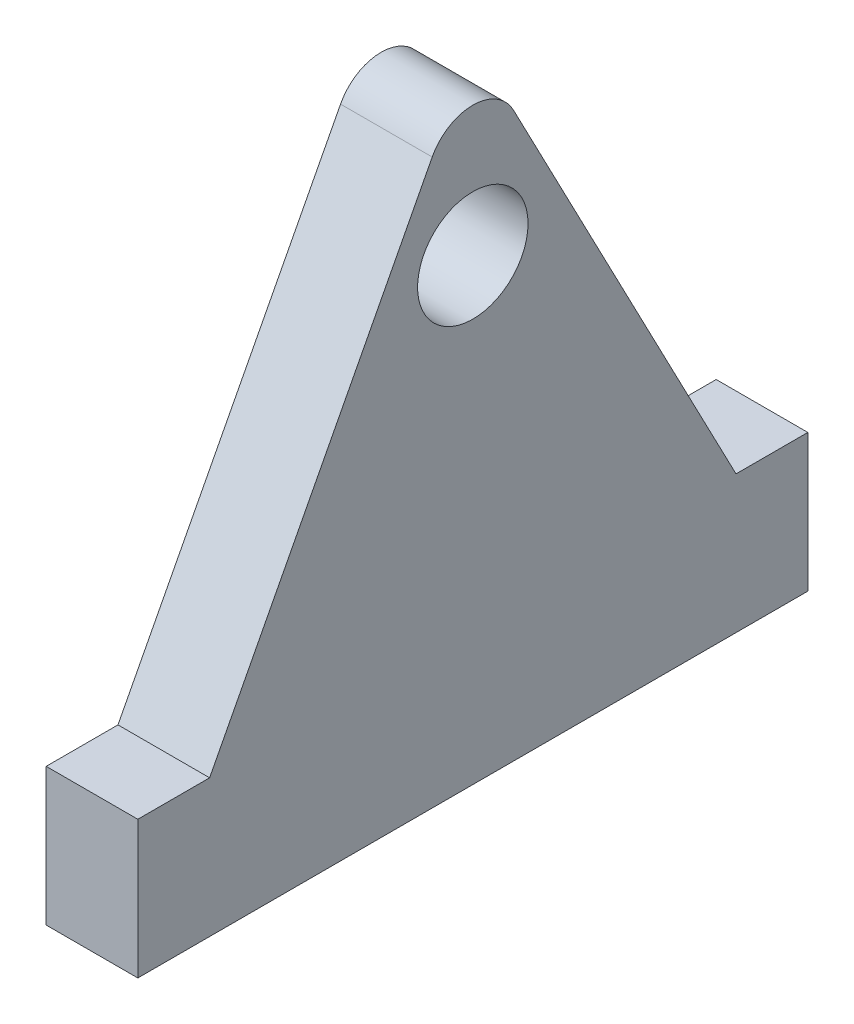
ISO-10303-21;
HEADER;
FILE_DESCRIPTION(('STEP AP214'),'2;1');
FILE_NAME('part.step','',(''),(''),'','','');
FILE_SCHEMA(('AUTOMOTIVE_DESIGN { 1 0 10303 214 1 1 1 1 }'));
ENDSEC;
DATA;
#1=APPLICATION_CONTEXT('core data for automotive mechanical design processes');
#2=APPLICATION_PROTOCOL_DEFINITION('international standard','automotive_design',2000,#1);
#3=PRODUCT_CONTEXT('',#1,'mechanical');
#4=PRODUCT('Part','Part','',(#3));
#5=PRODUCT_RELATED_PRODUCT_CATEGORY('part','',(#4));
#6=PRODUCT_DEFINITION_FORMATION('','',#4);
#7=PRODUCT_DEFINITION_CONTEXT('part definition',#1,'design');
#8=PRODUCT_DEFINITION('design','',#6,#7);
#9=PRODUCT_DEFINITION_SHAPE('','',#8);
#10=(LENGTH_UNIT() NAMED_UNIT(*) SI_UNIT(.MILLI.,.METRE.));
#11=(NAMED_UNIT(*) PLANE_ANGLE_UNIT() SI_UNIT($,.RADIAN.));
#12=(NAMED_UNIT(*) SI_UNIT($,.STERADIAN.) SOLID_ANGLE_UNIT());
#13=UNCERTAINTY_MEASURE_WITH_UNIT(LENGTH_MEASURE(1.E-05),#10,'distance_accuracy_value','');
#14=(GEOMETRIC_REPRESENTATION_CONTEXT(3) GLOBAL_UNCERTAINTY_ASSIGNED_CONTEXT((#13)) GLOBAL_UNIT_ASSIGNED_CONTEXT((#10,
#11,#12)) REPRESENTATION_CONTEXT('',''));
#15=CARTESIAN_POINT('',(0.,0.,0.));
#16=DIRECTION('',(0.,0.,1.));
#17=DIRECTION('',(1.,0.,0.));
#18=AXIS2_PLACEMENT_3D('',#15,#16,#17);
#19=CARTESIAN_POINT('',(30.,53.0229705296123,8.86438992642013));
#20=DIRECTION('',(0.,-0.462845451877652,-0.886438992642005));
#21=DIRECTION('',(0.,0.886438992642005,-0.462845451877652));
#22=AXIS2_PLACEMENT_3D('',#19,#20,#21);
#23=PLANE('',#22);
#24=DIRECTION('',(-1.,0.,0.));
#25=VECTOR('',#24,1.);
#26=CARTESIAN_POINT('',(30.,53.0229705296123,8.86438992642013));
#27=LINE('',#26,#25);
#28=CARTESIAN_POINT('',(30.,53.0229705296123,8.86438992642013));
#29=VERTEX_POINT('',#28);
#30=CARTESIAN_POINT('',(10.,53.0229705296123,8.86438992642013));
#31=VERTEX_POINT('',#30);
#32=EDGE_CURVE('E47',#29,#31,#27,.T.);
#33=ORIENTED_EDGE('',*,*,#32,.T.);
#34=DIRECTION('',(0.,-0.886438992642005,0.462845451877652));
#35=VECTOR('',#34,1.);
#36=CARTESIAN_POINT('',(10.,53.0229705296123,8.86438992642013));
#37=LINE('',#36,#35);
#38=CARTESIAN_POINT('',(10.,-40.,57.4354243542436));
#39=VERTEX_POINT('',#38);
#40=EDGE_CURVE('E137',#31,#39,#37,.T.);
#41=ORIENTED_EDGE('',*,*,#40,.T.);
#42=DIRECTION('',(-1.,0.,0.));
#43=VECTOR('',#42,1.);
#44=CARTESIAN_POINT('',(30.,-40.,57.4354243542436));
#45=LINE('',#44,#43);
#46=CARTESIAN_POINT('',(30.,-40.,57.4354243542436));
#47=VERTEX_POINT('',#46);
#48=EDGE_CURVE('E168',#47,#39,#45,.T.);
#49=ORIENTED_EDGE('',*,*,#48,.F.);
#50=DIRECTION('',(0.,-0.886438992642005,0.462845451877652));
#51=VECTOR('',#50,1.);
#52=CARTESIAN_POINT('',(30.,53.0229705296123,8.86438992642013));
#53=LINE('',#52,#51);
#54=EDGE_CURVE('E140',#29,#47,#53,.T.);
#55=ORIENTED_EDGE('',*,*,#54,.F.);
#56=EDGE_LOOP('',(#33,#41,#49,#55));
#57=FACE_BOUND('',#56,.T.);
#58=ADVANCED_FACE('F39',(#57),#23,.F.);
#59=CARTESIAN_POINT('',(30.,53.0229705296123,-8.86438992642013));
#60=DIRECTION('',(0.,0.462845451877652,-0.886438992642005));
#61=DIRECTION('',(0.,0.886438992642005,0.462845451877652));
#62=AXIS2_PLACEMENT_3D('',#59,#60,#61);
#63=PLANE('',#62);
#64=DIRECTION('',(0.,-0.886438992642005,-0.462845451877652));
#65=VECTOR('',#64,1.);
#66=CARTESIAN_POINT('',(10.,53.0229705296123,-8.86438992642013));
#67=LINE('',#66,#65);
#68=CARTESIAN_POINT('',(10.,53.0229705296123,-8.86438992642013));
#69=VERTEX_POINT('',#68);
#70=CARTESIAN_POINT('',(10.,-40.,-57.4354243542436));
#71=VERTEX_POINT('',#70);
#72=EDGE_CURVE('E148',#69,#71,#67,.T.);
#73=ORIENTED_EDGE('',*,*,#72,.F.);
#74=DIRECTION('',(-1.,0.,0.));
#75=VECTOR('',#74,1.);
#76=CARTESIAN_POINT('',(30.,53.0229705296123,-8.86438992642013));
#77=LINE('',#76,#75);
#78=CARTESIAN_POINT('',(30.,53.0229705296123,-8.86438992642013));
#79=VERTEX_POINT('',#78);
#80=EDGE_CURVE('E126',#79,#69,#77,.T.);
#81=ORIENTED_EDGE('',*,*,#80,.F.);
#82=DIRECTION('',(0.,-0.886438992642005,-0.462845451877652));
#83=VECTOR('',#82,1.);
#84=CARTESIAN_POINT('',(30.,53.0229705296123,-8.86438992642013));
#85=LINE('',#84,#83);
#86=CARTESIAN_POINT('',(30.,-40.,-57.4354243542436));
#87=VERTEX_POINT('',#86);
#88=EDGE_CURVE('E61',#79,#87,#85,.T.);
#89=ORIENTED_EDGE('',*,*,#88,.T.);
#90=DIRECTION('',(-1.,0.,0.));
#91=VECTOR('',#90,1.);
#92=CARTESIAN_POINT('',(30.,-40.,-57.4354243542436));
#93=LINE('',#92,#91);
#94=EDGE_CURVE('E165',#87,#71,#93,.T.);
#95=ORIENTED_EDGE('',*,*,#94,.T.);
#96=EDGE_LOOP('',(#73,#81,#89,#95));
#97=FACE_BOUND('',#96,.T.);
#98=ADVANCED_FACE('F200',(#97),#63,.T.);
#99=CARTESIAN_POINT('',(30.,48.394516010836,0.));
#100=DIRECTION('',(-1.,0.,0.));
#101=DIRECTION('',(0.,0.,1.));
#102=AXIS2_PLACEMENT_3D('',#99,#100,#101);
#103=CYLINDRICAL_SURFACE('',#102,10.);
#104=ORIENTED_EDGE('',*,*,#80,.T.);
#105=CARTESIAN_POINT('',(10.,48.394516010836,0.));
#106=DIRECTION('',(1.,0.,0.));
#107=DIRECTION('',(0.,0.,-1.));
#108=AXIS2_PLACEMENT_3D('',#105,#106,#107);
#109=CIRCLE('',#108,10.);
#110=EDGE_CURVE('E146',#69,#31,#109,.T.);
#111=ORIENTED_EDGE('',*,*,#110,.T.);
#112=ORIENTED_EDGE('',*,*,#32,.F.);
#113=CARTESIAN_POINT('',(30.,48.394516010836,0.));
#114=DIRECTION('',(1.,0.,0.));
#115=DIRECTION('',(0.,0.,-1.));
#116=AXIS2_PLACEMENT_3D('',#113,#114,#115);
#117=CIRCLE('',#116,10.);
#118=EDGE_CURVE('E145',#79,#29,#117,.T.);
#119=ORIENTED_EDGE('',*,*,#118,.F.);
#120=EDGE_LOOP('',(#104,#111,#112,#119));
#121=FACE_BOUND('',#120,.T.);
#122=ADVANCED_FACE('F41',(#121),#103,.T.);
#123=CARTESIAN_POINT('',(30.,-70.,73.09963099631));
#124=DIRECTION('',(0.,1.,0.));
#125=DIRECTION('',(0.,0.,1.));
#126=AXIS2_PLACEMENT_3D('',#123,#124,#125);
#127=PLANE('',#126);
#128=DIRECTION('',(-1.,0.,0.));
#129=VECTOR('',#128,1.);
#130=CARTESIAN_POINT('',(30.,-70.,73.09963099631));
#131=LINE('',#130,#129);
#132=CARTESIAN_POINT('',(30.,-70.,73.09963099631));
#133=VERTEX_POINT('',#132);
#134=CARTESIAN_POINT('',(10.,-70.,73.09963099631));
#135=VERTEX_POINT('',#134);
#136=EDGE_CURVE('E119',#133,#135,#131,.T.);
#137=ORIENTED_EDGE('',*,*,#136,.T.);
#138=DIRECTION('',(0.,0.,-1.));
#139=VECTOR('',#138,1.);
#140=CARTESIAN_POINT('',(10.,-70.,73.09963099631));
#141=LINE('',#140,#139);
#142=CARTESIAN_POINT('',(10.,-70.,-73.09963099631));
#143=VERTEX_POINT('',#142);
#144=EDGE_CURVE('E53',#135,#143,#141,.T.);
#145=ORIENTED_EDGE('',*,*,#144,.T.);
#146=DIRECTION('',(-1.,0.,0.));
#147=VECTOR('',#146,1.);
#148=CARTESIAN_POINT('',(30.,-70.,-73.09963099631));
#149=LINE('',#148,#147);
#150=CARTESIAN_POINT('',(30.,-70.,-73.09963099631));
#151=VERTEX_POINT('',#150);
#152=EDGE_CURVE('E116',#151,#143,#149,.T.);
#153=ORIENTED_EDGE('',*,*,#152,.F.);
#154=DIRECTION('',(0.,0.,-1.));
#155=VECTOR('',#154,1.);
#156=CARTESIAN_POINT('',(30.,-70.,73.09963099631));
#157=LINE('',#156,#155);
#158=EDGE_CURVE('E172',#133,#151,#157,.T.);
#159=ORIENTED_EDGE('',*,*,#158,.F.);
#160=EDGE_LOOP('',(#137,#145,#153,#159));
#161=FACE_BOUND('',#160,.T.);
#162=ADVANCED_FACE('F114',(#161),#127,.F.);
#163=CARTESIAN_POINT('',(30.,48.394516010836,0.));
#164=DIRECTION('',(1.,0.,0.));
#165=DIRECTION('',(0.,0.,-1.));
#166=AXIS2_PLACEMENT_3D('',#163,#164,#165);
#167=PLANE('',#166);
#168=CARTESIAN_POINT('',(30.,30.,0.));
#169=DIRECTION('',(1.,0.,0.));
#170=DIRECTION('',(0.,0.,-1.));
#171=AXIS2_PLACEMENT_3D('',#168,#169,#170);
#172=CIRCLE('',#171,12.05);
#173=CARTESIAN_POINT('',(30.,30.,-12.05));
#174=VERTEX_POINT('',#173);
#175=EDGE_CURVE('E121',#174,#174,#172,.T.);
#176=ORIENTED_EDGE('',*,*,#175,.F.);
#177=EDGE_LOOP('',(#176));
#178=FACE_BOUND('',#177,.T.);
#179=ORIENTED_EDGE('',*,*,#158,.T.);
#180=DIRECTION('',(0.,-1.,0.));
#181=VECTOR('',#180,1.);
#182=CARTESIAN_POINT('',(30.,-40.,-73.09963099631));
#183=LINE('',#182,#181);
#184=CARTESIAN_POINT('',(30.,-40.,-73.09963099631));
#185=VERTEX_POINT('',#184);
#186=EDGE_CURVE('E125',#185,#151,#183,.T.);
#187=ORIENTED_EDGE('',*,*,#186,.F.);
#188=DIRECTION('',(0.,0.,1.));
#189=VECTOR('',#188,1.);
#190=CARTESIAN_POINT('',(30.,-40.,73.09963099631));
#191=LINE('',#190,#189);
#192=EDGE_CURVE('E157',#185,#87,#191,.T.);
#193=ORIENTED_EDGE('',*,*,#192,.T.);
#194=ORIENTED_EDGE('',*,*,#88,.F.);
#195=ORIENTED_EDGE('',*,*,#118,.T.);
#196=ORIENTED_EDGE('',*,*,#54,.T.);
#197=CARTESIAN_POINT('',(30.,-40.,73.09963099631));
#198=VERTEX_POINT('',#197);
#199=EDGE_CURVE('E156',#47,#198,#191,.T.);
#200=ORIENTED_EDGE('',*,*,#199,.T.);
#201=DIRECTION('',(0.,-1.,0.));
#202=VECTOR('',#201,1.);
#203=CARTESIAN_POINT('',(30.,-40.,73.09963099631));
#204=LINE('',#203,#202);
#205=EDGE_CURVE('E163',#198,#133,#204,.T.);
#206=ORIENTED_EDGE('',*,*,#205,.T.);
#207=EDGE_LOOP('',(#179,#187,#193,#194,#195,#196,#200,#206));
#208=FACE_BOUND('',#207,.T.);
#209=ADVANCED_FACE('F174',(#178,#208),#167,.T.);
#210=CARTESIAN_POINT('',(0.,-40.,-73.09963099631));
#211=DIRECTION('',(0.,0.,-1.));
#212=DIRECTION('',(-1.,0.,0.));
#213=AXIS2_PLACEMENT_3D('',#210,#211,#212);
#214=PLANE('',#213);
#215=DIRECTION('',(0.,-1.,0.));
#216=VECTOR('',#215,1.);
#217=CARTESIAN_POINT('',(10.,-40.,-73.09963099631));
#218=LINE('',#217,#216);
#219=CARTESIAN_POINT('',(10.,-40.,-73.09963099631));
#220=VERTEX_POINT('',#219);
#221=EDGE_CURVE('E102',#220,#143,#218,.T.);
#222=ORIENTED_EDGE('',*,*,#221,.F.);
#223=DIRECTION('',(1.,0.,0.));
#224=VECTOR('',#223,1.);
#225=CARTESIAN_POINT('',(0.,-40.,-73.09963099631));
#226=LINE('',#225,#224);
#227=EDGE_CURVE('E109',#220,#185,#226,.T.);
#228=ORIENTED_EDGE('',*,*,#227,.T.);
#229=ORIENTED_EDGE('',*,*,#186,.T.);
#230=ORIENTED_EDGE('',*,*,#152,.T.);
#231=EDGE_LOOP('',(#222,#228,#229,#230));
#232=FACE_BOUND('',#231,.T.);
#233=ADVANCED_FACE('F123',(#232),#214,.T.);
#234=CARTESIAN_POINT('',(0.,-40.,0.));
#235=DIRECTION('',(0.,-1.,0.));
#236=DIRECTION('',(0.,0.,-1.));
#237=AXIS2_PLACEMENT_3D('',#234,#235,#236);
#238=PLANE('',#237);
#239=ORIENTED_EDGE('',*,*,#227,.F.);
#240=DIRECTION('',(0.,0.,1.));
#241=VECTOR('',#240,1.);
#242=CARTESIAN_POINT('',(10.,-40.,0.));
#243=LINE('',#242,#241);
#244=EDGE_CURVE('E105',#220,#71,#243,.T.);
#245=ORIENTED_EDGE('',*,*,#244,.T.);
#246=ORIENTED_EDGE('',*,*,#94,.F.);
#247=ORIENTED_EDGE('',*,*,#192,.F.);
#248=EDGE_LOOP('',(#239,#245,#246,#247));
#249=FACE_BOUND('',#248,.T.);
#250=ADVANCED_FACE('F213',(#249),#238,.F.);
#251=ORIENTED_EDGE('',*,*,#48,.T.);
#252=DIRECTION('',(0.,0.,1.));
#253=VECTOR('',#252,1.);
#254=CARTESIAN_POINT('',(10.,-40.,0.));
#255=LINE('',#254,#253);
#256=CARTESIAN_POINT('',(10.,-40.,73.09963099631));
#257=VERTEX_POINT('',#256);
#258=EDGE_CURVE('E120',#39,#257,#255,.T.);
#259=ORIENTED_EDGE('',*,*,#258,.T.);
#260=DIRECTION('',(-1.,0.,0.));
#261=VECTOR('',#260,1.);
#262=CARTESIAN_POINT('',(0.,-40.,73.09963099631));
#263=LINE('',#262,#261);
#264=EDGE_CURVE('E160',#198,#257,#263,.T.);
#265=ORIENTED_EDGE('',*,*,#264,.F.);
#266=ORIENTED_EDGE('',*,*,#199,.F.);
#267=EDGE_LOOP('',(#251,#259,#265,#266));
#268=FACE_BOUND('',#267,.T.);
#269=ADVANCED_FACE('F182',(#268),#238,.F.);
#270=CARTESIAN_POINT('',(0.,-40.,73.09963099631));
#271=DIRECTION('',(0.,0.,1.));
#272=DIRECTION('',(1.,0.,0.));
#273=AXIS2_PLACEMENT_3D('',#270,#271,#272);
#274=PLANE('',#273);
#275=DIRECTION('',(0.,1.,0.));
#276=VECTOR('',#275,1.);
#277=CARTESIAN_POINT('',(10.,-40.,73.09963099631));
#278=LINE('',#277,#276);
#279=EDGE_CURVE('E11',#135,#257,#278,.T.);
#280=ORIENTED_EDGE('',*,*,#279,.F.);
#281=ORIENTED_EDGE('',*,*,#136,.F.);
#282=ORIENTED_EDGE('',*,*,#205,.F.);
#283=ORIENTED_EDGE('',*,*,#264,.T.);
#284=EDGE_LOOP('',(#280,#281,#282,#283));
#285=FACE_BOUND('',#284,.T.);
#286=ADVANCED_FACE('F179',(#285),#274,.T.);
#287=CARTESIAN_POINT('',(10.,-70.,73.09963099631));
#288=DIRECTION('',(1.,0.,0.));
#289=DIRECTION('',(0.,0.,-1.));
#290=AXIS2_PLACEMENT_3D('',#287,#288,#289);
#291=PLANE('',#290);
#292=CARTESIAN_POINT('',(10.,30.,0.));
#293=DIRECTION('',(1.,0.,0.));
#294=DIRECTION('',(0.,0.,-1.));
#295=AXIS2_PLACEMENT_3D('',#292,#293,#294);
#296=CIRCLE('',#295,12.05);
#297=CARTESIAN_POINT('',(10.,30.,-12.05));
#298=VERTEX_POINT('',#297);
#299=EDGE_CURVE('E186',#298,#298,#296,.T.);
#300=ORIENTED_EDGE('',*,*,#299,.T.);
#301=EDGE_LOOP('',(#300));
#302=FACE_BOUND('',#301,.T.);
#303=ORIENTED_EDGE('',*,*,#221,.T.);
#304=ORIENTED_EDGE('',*,*,#144,.F.);
#305=ORIENTED_EDGE('',*,*,#279,.T.);
#306=ORIENTED_EDGE('',*,*,#258,.F.);
#307=ORIENTED_EDGE('',*,*,#40,.F.);
#308=ORIENTED_EDGE('',*,*,#110,.F.);
#309=ORIENTED_EDGE('',*,*,#72,.T.);
#310=ORIENTED_EDGE('',*,*,#244,.F.);
#311=EDGE_LOOP('',(#303,#304,#305,#306,#307,#308,#309,#310));
#312=FACE_BOUND('',#311,.T.);
#313=ADVANCED_FACE('F103',(#302,#312),#291,.F.);
#314=CARTESIAN_POINT('',(10.,30.,0.));
#315=DIRECTION('',(1.,0.,0.));
#316=DIRECTION('',(0.,0.,-1.));
#317=AXIS2_PLACEMENT_3D('',#314,#315,#316);
#318=CYLINDRICAL_SURFACE('',#317,12.05);
#319=ORIENTED_EDGE('',*,*,#175,.T.);
#320=EDGE_LOOP('',(#319));
#321=FACE_BOUND('',#320,.T.);
#322=ORIENTED_EDGE('',*,*,#299,.F.);
#323=EDGE_LOOP('',(#322));
#324=FACE_BOUND('',#323,.T.);
#325=ADVANCED_FACE('F191',(#321,#324),#318,.F.);
#326=CLOSED_SHELL('',(#58,#98,#122,#162,#209,#233,#250,#269,#286,#313,#325));
#327=MANIFOLD_SOLID_BREP('B2',#326);
#328=ADVANCED_BREP_SHAPE_REPRESENTATION('',(#18,#327),#14);
#329=SHAPE_DEFINITION_REPRESENTATION(#9,#328);
ENDSEC;
END-ISO-10303-21;
